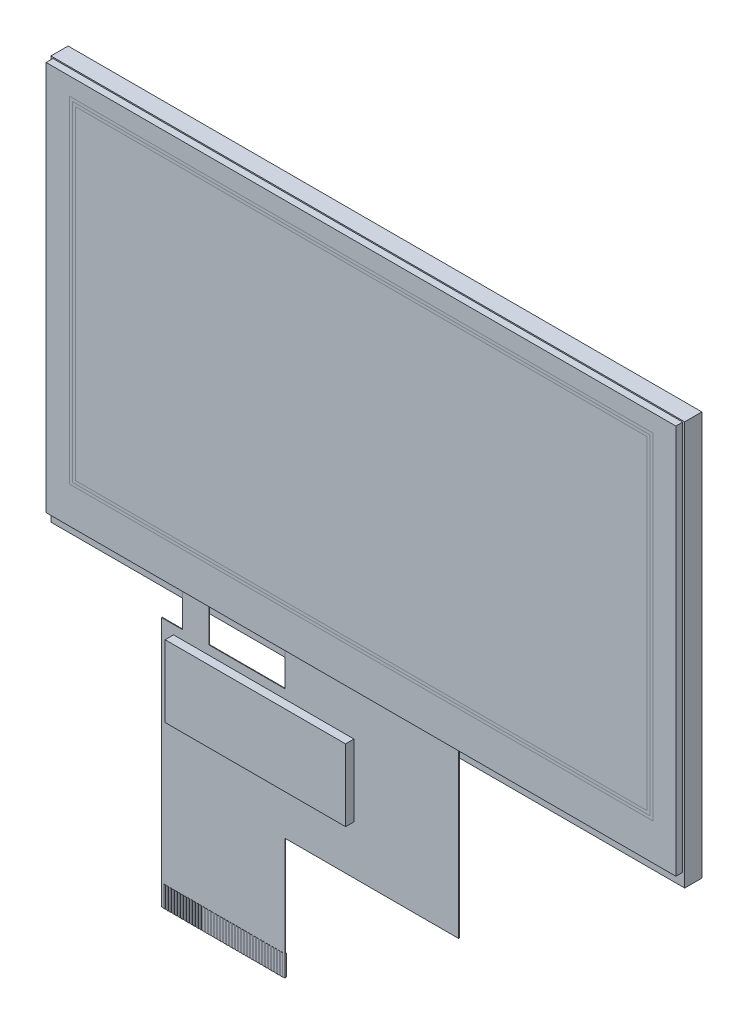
from build123d import *

# Parameters (mm, degrees)
SKETCH1_W              = 104.73
SKETCH1_H              = 64.84
SKETCH1_W_2            = 97.04
SKETCH1_H_2            = 55.86
SKETCH1_W_3            = 96.04
SKETCH1_H_3            = 54.86
SKETCH1_W_4            = 95.04
SKETCH1_H_4            = 53.86
BOSS_EXTRUDE5_DEPTH    = 4
SKETCH2_W              = 105.4
SKETCH2_H              = 67.15
BOSS_EXTRUDE6_DEPTH    = 2.86
BOSS_EXTRUDE7_DEPTH    = 0.1
SKETCH4_W              = 0.3
SKETCH4_H              = 3.5
BOSS_EXTRUDE8_DEPTH    = 0.05
BOSS_EXTRUDE8_2_DEPTH  = 0.05
BOSS_EXTRUDE8_3_DEPTH  = 0.05
BOSS_EXTRUDE8_4_DEPTH  = 0.05
BOSS_EXTRUDE8_5_DEPTH  = 0.05
BOSS_EXTRUDE8_6_DEPTH  = 0.05
BOSS_EXTRUDE8_7_DEPTH  = 0.05
BOSS_EXTRUDE8_8_DEPTH  = 0.05
BOSS_EXTRUDE8_9_DEPTH  = 0.05
BOSS_EXTRUDE8_10_DEPTH = 0.05
BOSS_EXTRUDE8_11_DEPTH = 0.05
BOSS_EXTRUDE8_12_DEPTH = 0.05
BOSS_EXTRUDE8_13_DEPTH = 0.05
BOSS_EXTRUDE8_14_DEPTH = 0.05
BOSS_EXTRUDE8_15_DEPTH = 0.05
BOSS_EXTRUDE8_16_DEPTH = 0.05
BOSS_EXTRUDE8_17_DEPTH = 0.05
BOSS_EXTRUDE8_18_DEPTH = 0.05
BOSS_EXTRUDE8_19_DEPTH = 0.05
BOSS_EXTRUDE8_20_DEPTH = 0.05
BOSS_EXTRUDE8_21_DEPTH = 0.05
BOSS_EXTRUDE8_22_DEPTH = 0.05
BOSS_EXTRUDE8_23_DEPTH = 0.05
BOSS_EXTRUDE8_24_DEPTH = 0.05
BOSS_EXTRUDE8_25_DEPTH = 0.05
BOSS_EXTRUDE8_26_DEPTH = 0.05
BOSS_EXTRUDE8_27_DEPTH = 0.05
BOSS_EXTRUDE8_28_DEPTH = 0.05
BOSS_EXTRUDE8_29_DEPTH = 0.05
BOSS_EXTRUDE8_30_DEPTH = 0.05
BOSS_EXTRUDE8_31_DEPTH = 0.05
BOSS_EXTRUDE8_32_DEPTH = 0.05
BOSS_EXTRUDE8_33_DEPTH = 0.05
BOSS_EXTRUDE8_34_DEPTH = 0.05
BOSS_EXTRUDE8_35_DEPTH = 0.05
BOSS_EXTRUDE8_36_DEPTH = 0.05
BOSS_EXTRUDE8_37_DEPTH = 0.05
BOSS_EXTRUDE8_38_DEPTH = 0.05
BOSS_EXTRUDE8_39_DEPTH = 0.05
BOSS_EXTRUDE8_40_DEPTH = 0.05
SKETCH5_W              = 20.5
SKETCH5_H              = 3.5
BOSS_EXTRUDE9_DEPTH    = 0.15
SKETCH6_W              = 30
SKETCH6_H              = 11.927691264
BOSS_EXTRUDE10_DEPTH   = 1.4


with BuildPart() as part:
    # Sketch1 → Boss-Extrude5 (new body)
    # profile 1 of 4: a face of its own
    with BuildSketch(Plane.XY):
        with Locations((-0.005, 0.955)):
            Rectangle(SKETCH1_W, SKETCH1_H)
        with Locations((0, 2.525)):
            Rectangle(SKETCH1_W_2, SKETCH1_H_2, mode=Mode.SUBTRACT)
    # profile 2 of 4: a face of its own
    with BuildSketch(Plane.XY):
        with Locations((0, 2.525)):
            Rectangle(SKETCH1_W_2, SKETCH1_H_2)
        with Locations((0, 2.525)):
            Rectangle(SKETCH1_W_3, SKETCH1_H_3, mode=Mode.SUBTRACT)
    # profile 3 of 4: a face of its own
    with BuildSketch(Plane.XY):
        with Locations((0, 2.525)):
            Rectangle(SKETCH1_W_3, SKETCH1_H_3)
        with Locations((0, 2.525)):
            Rectangle(SKETCH1_W_4, SKETCH1_H_4, mode=Mode.SUBTRACT)
    # profile 4 of 4: a face of its own
    with BuildSketch(Plane.XY):
        with Locations((0, 2.525)):
            Rectangle(SKETCH1_W_4, SKETCH1_H_4)
    extrude(amount=BOSS_EXTRUDE5_DEPTH)

    # Sketch2 → Boss-Extrude6 (add)
    with BuildSketch(Plane(origin=(0, 0, 0), x_dir=(-1, 0, 0), z_dir=(0, 0, -1))):
        with Locations((0.01, 0)):
            Rectangle(SKETCH2_W, SKETCH2_H)
    extrude(amount=-BOSS_EXTRUDE6_DEPTH)

    # Sketch3 → Boss-Extrude7 (add)
    with BuildSketch(Plane.XY.offset(2.86)):
        Polygon((-26.31, -31.465), (-30.71, -31.465), (-30.71, -38.005), (-34.21, -38.005), (-34.21, -79.675), (-13.71, -79.675), (-13.71, -59.535), (15.2, -59.535), (15.2, -31.465), (-13.71, -31.465), (-13.71, -38.005), (-26.31, -38.005), align=None)
    extrude(amount=BOSS_EXTRUDE7_DEPTH)

    # Sketch5 → Boss-Extrude9 (add)
    with BuildSketch(Plane(origin=(0, 0, 2.86), x_dir=(-1, 0, 0), z_dir=(0, 0, -1))):
        with Locations((23.96, -77.925)):
            Rectangle(SKETCH5_W, SKETCH5_H)
    extrude(amount=BOSS_EXTRUDE9_DEPTH)


with BuildPart() as body_2:
    # Sketch4 → Boss-Extrude8 (new body)
    with BuildSketch(Plane.XY.offset(2.96)):
        with Locations((-33.71, -77.925)):
            Rectangle(SKETCH4_W, SKETCH4_H)
    extrude(amount=BOSS_EXTRUDE8_DEPTH)


with BuildPart() as body_3:
    # Sketch4 → Boss-Extrude8 2 (new body)
    with BuildSketch(Plane.XY.offset(2.96)):
        with Locations((-33.21, -77.925)):
            Rectangle(SKETCH4_W, SKETCH4_H)
    extrude(amount=BOSS_EXTRUDE8_2_DEPTH)


with BuildPart() as body_4:
    # Sketch4 → Boss-Extrude8 3 (new body)
    with BuildSketch(Plane.XY.offset(2.96)):
        with Locations((-32.71, -77.925)):
            Rectangle(SKETCH4_W, SKETCH4_H)
    extrude(amount=BOSS_EXTRUDE8_3_DEPTH)


with BuildPart() as body_5:
    # Sketch4 → Boss-Extrude8 4 (new body)
    with BuildSketch(Plane.XY.offset(2.96)):
        with Locations((-32.21, -77.925)):
            Rectangle(SKETCH4_W, SKETCH4_H)
    extrude(amount=BOSS_EXTRUDE8_4_DEPTH)


with BuildPart() as body_6:
    # Sketch4 → Boss-Extrude8 5 (new body)
    with BuildSketch(Plane.XY.offset(2.96)):
        with Locations((-31.71, -77.925)):
            Rectangle(SKETCH4_W, SKETCH4_H)
    extrude(amount=BOSS_EXTRUDE8_5_DEPTH)


with BuildPart() as body_7:
    # Sketch4 → Boss-Extrude8 6 (new body)
    with BuildSketch(Plane.XY.offset(2.96)):
        with Locations((-31.21, -77.925)):
            Rectangle(SKETCH4_W, SKETCH4_H)
    extrude(amount=BOSS_EXTRUDE8_6_DEPTH)


with BuildPart() as body_8:
    # Sketch4 → Boss-Extrude8 7 (new body)
    with BuildSketch(Plane.XY.offset(2.96)):
        with Locations((-30.71, -77.925)):
            Rectangle(SKETCH4_W, SKETCH4_H)
    extrude(amount=BOSS_EXTRUDE8_7_DEPTH)


with BuildPart() as body_9:
    # Sketch4 → Boss-Extrude8 8 (new body)
    with BuildSketch(Plane.XY.offset(2.96)):
        with Locations((-30.21, -77.925)):
            Rectangle(SKETCH4_W, SKETCH4_H)
    extrude(amount=BOSS_EXTRUDE8_8_DEPTH)


with BuildPart() as body_10:
    # Sketch4 → Boss-Extrude8 9 (new body)
    with BuildSketch(Plane.XY.offset(2.96)):
        with Locations((-29.71, -77.925)):
            Rectangle(SKETCH4_W, SKETCH4_H)
    extrude(amount=BOSS_EXTRUDE8_9_DEPTH)


with BuildPart() as body_11:
    # Sketch4 → Boss-Extrude8 10 (new body)
    with BuildSketch(Plane.XY.offset(2.96)):
        with Locations((-29.21, -77.925)):
            Rectangle(SKETCH4_W, SKETCH4_H)
    extrude(amount=BOSS_EXTRUDE8_10_DEPTH)


with BuildPart() as body_12:
    # Sketch4 → Boss-Extrude8 11 (new body)
    with BuildSketch(Plane.XY.offset(2.96)):
        with Locations((-28.71, -77.925)):
            Rectangle(SKETCH4_W, SKETCH4_H)
    extrude(amount=BOSS_EXTRUDE8_11_DEPTH)


with BuildPart() as body_13:
    # Sketch4 → Boss-Extrude8 12 (new body)
    with BuildSketch(Plane.XY.offset(2.96)):
        with Locations((-28.21, -77.925)):
            Rectangle(SKETCH4_W, SKETCH4_H)
    extrude(amount=BOSS_EXTRUDE8_12_DEPTH)


with BuildPart() as body_14:
    # Sketch4 → Boss-Extrude8 13 (new body)
    with BuildSketch(Plane.XY.offset(2.96)):
        with Locations((-27.71, -77.925)):
            Rectangle(SKETCH4_W, SKETCH4_H)
    extrude(amount=BOSS_EXTRUDE8_13_DEPTH)


with BuildPart() as body_15:
    # Sketch4 → Boss-Extrude8 14 (new body)
    with BuildSketch(Plane.XY.offset(2.96)):
        with Locations((-27.21, -77.925)):
            Rectangle(SKETCH4_W, SKETCH4_H)
    extrude(amount=BOSS_EXTRUDE8_14_DEPTH)


with BuildPart() as body_16:
    # Sketch4 → Boss-Extrude8 15 (new body)
    with BuildSketch(Plane.XY.offset(2.96)):
        with Locations((-26.71, -77.925)):
            Rectangle(SKETCH4_W, SKETCH4_H)
    extrude(amount=BOSS_EXTRUDE8_15_DEPTH)


with BuildPart() as body_17:
    # Sketch4 → Boss-Extrude8 16 (new body)
    with BuildSketch(Plane.XY.offset(2.96)):
        with Locations((-26.21, -77.925)):
            Rectangle(SKETCH4_W, SKETCH4_H)
    extrude(amount=BOSS_EXTRUDE8_16_DEPTH)


with BuildPart() as body_18:
    # Sketch4 → Boss-Extrude8 17 (new body)
    with BuildSketch(Plane.XY.offset(2.96)):
        with Locations((-25.71, -77.925)):
            Rectangle(SKETCH4_W, SKETCH4_H)
    extrude(amount=BOSS_EXTRUDE8_17_DEPTH)


with BuildPart() as body_19:
    # Sketch4 → Boss-Extrude8 18 (new body)
    with BuildSketch(Plane.XY.offset(2.96)):
        with Locations((-25.21, -77.925)):
            Rectangle(SKETCH4_W, SKETCH4_H)
    extrude(amount=BOSS_EXTRUDE8_18_DEPTH)


with BuildPart() as body_20:
    # Sketch4 → Boss-Extrude8 19 (new body)
    with BuildSketch(Plane.XY.offset(2.96)):
        with Locations((-24.71, -77.925)):
            Rectangle(SKETCH4_W, SKETCH4_H)
    extrude(amount=BOSS_EXTRUDE8_19_DEPTH)


with BuildPart() as body_21:
    # Sketch4 → Boss-Extrude8 20 (new body)
    with BuildSketch(Plane.XY.offset(2.96)):
        with Locations((-24.21, -77.925)):
            Rectangle(SKETCH4_W, SKETCH4_H)
    extrude(amount=BOSS_EXTRUDE8_20_DEPTH)


with BuildPart() as body_22:
    # Sketch4 → Boss-Extrude8 21 (new body)
    with BuildSketch(Plane.XY.offset(2.96)):
        with Locations((-23.71, -77.925)):
            Rectangle(SKETCH4_W, SKETCH4_H)
    extrude(amount=BOSS_EXTRUDE8_21_DEPTH)


with BuildPart() as body_23:
    # Sketch4 → Boss-Extrude8 22 (new body)
    with BuildSketch(Plane.XY.offset(2.96)):
        with Locations((-23.21, -77.925)):
            Rectangle(SKETCH4_W, SKETCH4_H)
    extrude(amount=BOSS_EXTRUDE8_22_DEPTH)


with BuildPart() as body_24:
    # Sketch4 → Boss-Extrude8 23 (new body)
    with BuildSketch(Plane.XY.offset(2.96)):
        with Locations((-22.71, -77.925)):
            Rectangle(SKETCH4_W, SKETCH4_H)
    extrude(amount=BOSS_EXTRUDE8_23_DEPTH)


with BuildPart() as body_25:
    # Sketch4 → Boss-Extrude8 24 (new body)
    with BuildSketch(Plane.XY.offset(2.96)):
        with Locations((-22.21, -77.925)):
            Rectangle(SKETCH4_W, SKETCH4_H)
    extrude(amount=BOSS_EXTRUDE8_24_DEPTH)


with BuildPart() as body_26:
    # Sketch4 → Boss-Extrude8 25 (new body)
    with BuildSketch(Plane.XY.offset(2.96)):
        with Locations((-21.71, -77.925)):
            Rectangle(SKETCH4_W, SKETCH4_H)
    extrude(amount=BOSS_EXTRUDE8_25_DEPTH)


with BuildPart() as body_27:
    # Sketch4 → Boss-Extrude8 26 (new body)
    with BuildSketch(Plane.XY.offset(2.96)):
        with Locations((-21.21, -77.925)):
            Rectangle(SKETCH4_W, SKETCH4_H)
    extrude(amount=BOSS_EXTRUDE8_26_DEPTH)


with BuildPart() as body_28:
    # Sketch4 → Boss-Extrude8 27 (new body)
    with BuildSketch(Plane.XY.offset(2.96)):
        with Locations((-20.71, -77.925)):
            Rectangle(SKETCH4_W, SKETCH4_H)
    extrude(amount=BOSS_EXTRUDE8_27_DEPTH)


with BuildPart() as body_29:
    # Sketch4 → Boss-Extrude8 28 (new body)
    with BuildSketch(Plane.XY.offset(2.96)):
        with Locations((-20.21, -77.925)):
            Rectangle(SKETCH4_W, SKETCH4_H)
    extrude(amount=BOSS_EXTRUDE8_28_DEPTH)


with BuildPart() as body_30:
    # Sketch4 → Boss-Extrude8 29 (new body)
    with BuildSketch(Plane.XY.offset(2.96)):
        with Locations((-19.71, -77.925)):
            Rectangle(SKETCH4_W, SKETCH4_H)
    extrude(amount=BOSS_EXTRUDE8_29_DEPTH)


with BuildPart() as body_31:
    # Sketch4 → Boss-Extrude8 30 (new body)
    with BuildSketch(Plane.XY.offset(2.96)):
        with Locations((-19.21, -77.925)):
            Rectangle(SKETCH4_W, SKETCH4_H)
    extrude(amount=BOSS_EXTRUDE8_30_DEPTH)


with BuildPart() as body_32:
    # Sketch4 → Boss-Extrude8 31 (new body)
    with BuildSketch(Plane.XY.offset(2.96)):
        with Locations((-18.71, -77.925)):
            Rectangle(SKETCH4_W, SKETCH4_H)
    extrude(amount=BOSS_EXTRUDE8_31_DEPTH)


with BuildPart() as body_33:
    # Sketch4 → Boss-Extrude8 32 (new body)
    with BuildSketch(Plane.XY.offset(2.96)):
        with Locations((-18.21, -77.925)):
            Rectangle(SKETCH4_W, SKETCH4_H)
    extrude(amount=BOSS_EXTRUDE8_32_DEPTH)


with BuildPart() as body_34:
    # Sketch4 → Boss-Extrude8 33 (new body)
    with BuildSketch(Plane.XY.offset(2.96)):
        with Locations((-17.71, -77.925)):
            Rectangle(SKETCH4_W, SKETCH4_H)
    extrude(amount=BOSS_EXTRUDE8_33_DEPTH)


with BuildPart() as body_35:
    # Sketch4 → Boss-Extrude8 34 (new body)
    with BuildSketch(Plane.XY.offset(2.96)):
        with Locations((-17.21, -77.925)):
            Rectangle(SKETCH4_W, SKETCH4_H)
    extrude(amount=BOSS_EXTRUDE8_34_DEPTH)


with BuildPart() as body_36:
    # Sketch4 → Boss-Extrude8 35 (new body)
    with BuildSketch(Plane.XY.offset(2.96)):
        with Locations((-16.71, -77.925)):
            Rectangle(SKETCH4_W, SKETCH4_H)
    extrude(amount=BOSS_EXTRUDE8_35_DEPTH)


with BuildPart() as body_37:
    # Sketch4 → Boss-Extrude8 36 (new body)
    with BuildSketch(Plane.XY.offset(2.96)):
        with Locations((-16.21, -77.925)):
            Rectangle(SKETCH4_W, SKETCH4_H)
    extrude(amount=BOSS_EXTRUDE8_36_DEPTH)


with BuildPart() as body_38:
    # Sketch4 → Boss-Extrude8 37 (new body)
    with BuildSketch(Plane.XY.offset(2.96)):
        with Locations((-15.71, -77.925)):
            Rectangle(SKETCH4_W, SKETCH4_H)
    extrude(amount=BOSS_EXTRUDE8_37_DEPTH)


with BuildPart() as body_39:
    # Sketch4 → Boss-Extrude8 38 (new body)
    with BuildSketch(Plane.XY.offset(2.96)):
        with Locations((-15.21, -77.925)):
            Rectangle(SKETCH4_W, SKETCH4_H)
    extrude(amount=BOSS_EXTRUDE8_38_DEPTH)


with BuildPart() as body_40:
    # Sketch4 → Boss-Extrude8 39 (new body)
    with BuildSketch(Plane.XY.offset(2.96)):
        with Locations((-14.71, -77.925)):
            Rectangle(SKETCH4_W, SKETCH4_H)
    extrude(amount=BOSS_EXTRUDE8_39_DEPTH)


with BuildPart() as body_41:
    # Sketch4 → Boss-Extrude8 40 (new body)
    with BuildSketch(Plane.XY.offset(2.96)):
        with Locations((-14.21, -77.925)):
            Rectangle(SKETCH4_W, SKETCH4_H)
    extrude(amount=BOSS_EXTRUDE8_40_DEPTH)


with BuildPart() as body_42:
    # Sketch6 → Boss-Extrude10 (new body)
    with BuildSketch(Plane.XY.offset(2.96)):
        with Locations((-17.21, -45.468845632)):
            Rectangle(SKETCH6_W, SKETCH6_H)
    extrude(amount=BOSS_EXTRUDE10_DEPTH)


solid = Compound([part.part, body_2.part, body_3.part, body_4.part, body_5.part, body_6.part, body_7.part, body_8.part, body_9.part, body_10.part, body_11.part, body_12.part, body_13.part, body_14.part, body_15.part, body_16.part, body_17.part, body_18.part, body_19.part, body_20.part, body_21.part, body_22.part, body_23.part, body_24.part, body_25.part, body_26.part, body_27.part, body_28.part, body_29.part, body_30.part, body_31.part, body_32.part, body_33.part, body_34.part, body_35.part, body_36.part, body_37.part, body_38.part, body_39.part, body_40.part, body_41.part, body_42.part])
